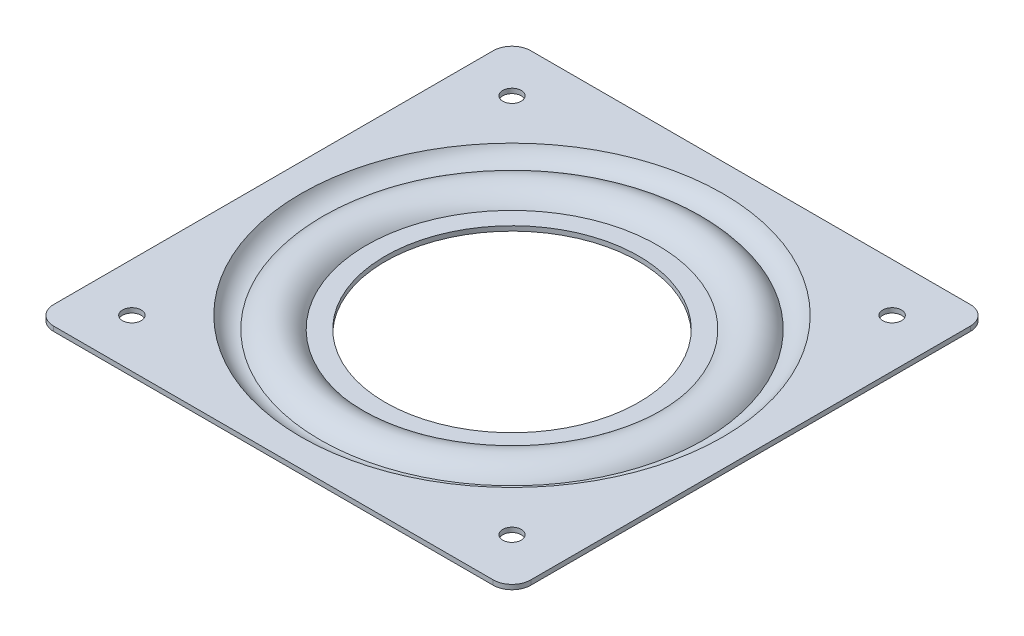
ISO-10303-21;
HEADER;
FILE_DESCRIPTION(('STEP AP214'),'2;1');
FILE_NAME('part.step','',(''),(''),'','','');
FILE_SCHEMA(('AUTOMOTIVE_DESIGN { 1 0 10303 214 1 1 1 1 }'));
ENDSEC;
DATA;
#1=APPLICATION_CONTEXT('core data for automotive mechanical design processes');
#2=APPLICATION_PROTOCOL_DEFINITION('international standard','automotive_design',2000,#1);
#3=PRODUCT_CONTEXT('',#1,'mechanical');
#4=PRODUCT('Part','Part','',(#3));
#5=PRODUCT_RELATED_PRODUCT_CATEGORY('part','',(#4));
#6=PRODUCT_DEFINITION_FORMATION('','',#4);
#7=PRODUCT_DEFINITION_CONTEXT('part definition',#1,'design');
#8=PRODUCT_DEFINITION('design','',#6,#7);
#9=PRODUCT_DEFINITION_SHAPE('','',#8);
#10=(LENGTH_UNIT() NAMED_UNIT(*) SI_UNIT(.MILLI.,.METRE.));
#11=(NAMED_UNIT(*) PLANE_ANGLE_UNIT() SI_UNIT($,.RADIAN.));
#12=(NAMED_UNIT(*) SI_UNIT($,.STERADIAN.) SOLID_ANGLE_UNIT());
#13=UNCERTAINTY_MEASURE_WITH_UNIT(LENGTH_MEASURE(1.E-05),#10,'distance_accuracy_value','');
#14=(GEOMETRIC_REPRESENTATION_CONTEXT(3) GLOBAL_UNCERTAINTY_ASSIGNED_CONTEXT((#13)) GLOBAL_UNIT_ASSIGNED_CONTEXT((#10,
#11,#12)) REPRESENTATION_CONTEXT('',''));
#15=CARTESIAN_POINT('',(0.,0.,0.));
#16=DIRECTION('',(0.,0.,1.));
#17=DIRECTION('',(1.,0.,0.));
#18=AXIS2_PLACEMENT_3D('',#15,#16,#17);
#19=CARTESIAN_POINT('',(0.,1.93021402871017,0.));
#20=DIRECTION('',(0.,1.,0.));
#21=DIRECTION('',(0.,0.,1.));
#22=AXIS2_PLACEMENT_3D('',#19,#20,#21);
#23=TOROIDAL_SURFACE('',#22,40.8455333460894,5.5);
#24=CARTESIAN_POINT('',(0.,-3.5402036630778,0.));
#25=DIRECTION('',(0.,1.,0.));
#26=DIRECTION('',(0.,0.,1.));
#27=AXIS2_PLACEMENT_3D('',#24,#25,#26);
#28=CIRCLE('',#27,40.2758577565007);
#29=CARTESIAN_POINT('',(0.,-3.5402036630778,40.2758577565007));
#30=VERTEX_POINT('',#29);
#31=EDGE_CURVE('E11',#30,#30,#28,.T.);
#32=ORIENTED_EDGE('',*,*,#31,.T.);
#33=EDGE_LOOP('',(#32));
#34=FACE_BOUND('',#33,.T.);
#35=CARTESIAN_POINT('',(0.,-1.,0.));
#36=DIRECTION('',(0.,1.,0.));
#37=DIRECTION('',(0.,0.,1.));
#38=AXIS2_PLACEMENT_3D('',#35,#36,#37);
#39=CIRCLE('',#38,45.4999770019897);
#40=CARTESIAN_POINT('',(0.,-1.,45.4999770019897));
#41=VERTEX_POINT('',#40);
#42=EDGE_CURVE('E50',#41,#41,#39,.F.);
#43=ORIENTED_EDGE('',*,*,#42,.T.);
#44=EDGE_LOOP('',(#43));
#45=FACE_BOUND('',#44,.T.);
#46=ADVANCED_FACE('F47',(#34,#45),#23,.T.);
#47=CARTESIAN_POINT('',(0.,-6.,0.));
#48=DIRECTION('',(0.,1.,0.));
#49=DIRECTION('',(0.,0.,1.));
#50=AXIS2_PLACEMENT_3D('',#47,#48,#49);
#51=TOROIDAL_SURFACE('',#50,35.9227666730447,5.);
#52=CARTESIAN_POINT('',(0.,-3.56978597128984,0.));
#53=DIRECTION('',(0.,1.,0.));
#54=DIRECTION('',(0.,0.,1.));
#55=AXIS2_PLACEMENT_3D('',#52,#53,#54);
#56=CIRCLE('',#55,31.5530916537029);
#57=CARTESIAN_POINT('',(0.,-3.56978597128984,31.5530916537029));
#58=VERTEX_POINT('',#57);
#59=EDGE_CURVE('E57',#58,#58,#56,.T.);
#60=ORIENTED_EDGE('',*,*,#59,.T.);
#61=EDGE_LOOP('',(#60));
#62=FACE_BOUND('',#61,.T.);
#63=ORIENTED_EDGE('',*,*,#31,.F.);
#64=EDGE_LOOP('',(#63));
#65=FACE_BOUND('',#64,.T.);
#66=ADVANCED_FACE('F239',(#62,#65),#51,.F.);
#67=CARTESIAN_POINT('',(0.,-3.56978597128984,0.));
#68=DIRECTION('',(0.,-1.,0.));
#69=DIRECTION('',(0.,0.,-1.));
#70=AXIS2_PLACEMENT_3D('',#67,#68,#69);
#71=PLANE('',#70);
#72=CARTESIAN_POINT('',(0.,-3.56978597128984,0.));
#73=DIRECTION('',(0.,1.,0.));
#74=DIRECTION('',(0.,0.,1.));
#75=AXIS2_PLACEMENT_3D('',#72,#73,#74);
#76=CIRCLE('',#75,27.);
#77=CARTESIAN_POINT('',(0.,-3.56978597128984,27.));
#78=VERTEX_POINT('',#77);
#79=EDGE_CURVE('E231',#78,#78,#76,.T.);
#80=ORIENTED_EDGE('',*,*,#79,.T.);
#81=EDGE_LOOP('',(#80));
#82=FACE_BOUND('',#81,.T.);
#83=ORIENTED_EDGE('',*,*,#59,.F.);
#84=EDGE_LOOP('',(#83));
#85=FACE_BOUND('',#84,.T.);
#86=ADVANCED_FACE('F242',(#82,#85),#71,.T.);
#87=CARTESIAN_POINT('',(0.,6.91716042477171,0.));
#88=DIRECTION('',(0.,1.,0.));
#89=DIRECTION('',(0.,0.,1.));
#90=AXIS2_PLACEMENT_3D('',#87,#88,#89);
#91=CYLINDRICAL_SURFACE('',#90,27.);
#92=ORIENTED_EDGE('',*,*,#79,.F.);
#93=EDGE_LOOP('',(#92));
#94=FACE_BOUND('',#93,.T.);
#95=CARTESIAN_POINT('',(0.,-2.56978597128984,0.));
#96=DIRECTION('',(0.,1.,0.));
#97=DIRECTION('',(0.,0.,1.));
#98=AXIS2_PLACEMENT_3D('',#95,#96,#97);
#99=CIRCLE('',#98,27.);
#100=CARTESIAN_POINT('',(0.,-2.56978597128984,27.));
#101=VERTEX_POINT('',#100);
#102=EDGE_CURVE('E227',#101,#101,#99,.T.);
#103=ORIENTED_EDGE('',*,*,#102,.T.);
#104=EDGE_LOOP('',(#103));
#105=FACE_BOUND('',#104,.T.);
#106=ADVANCED_FACE('F244',(#94,#105),#91,.F.);
#107=CARTESIAN_POINT('',(0.,-2.56978597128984,0.));
#108=DIRECTION('',(0.,-1.,0.));
#109=DIRECTION('',(0.,0.,-1.));
#110=AXIS2_PLACEMENT_3D('',#107,#108,#109);
#111=PLANE('',#110);
#112=ORIENTED_EDGE('',*,*,#102,.F.);
#113=EDGE_LOOP('',(#112));
#114=FACE_BOUND('',#113,.T.);
#115=CARTESIAN_POINT('',(0.,-2.56978597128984,0.));
#116=DIRECTION('',(0.,1.,0.));
#117=DIRECTION('',(0.,0.,1.));
#118=AXIS2_PLACEMENT_3D('',#115,#116,#117);
#119=CIRCLE('',#118,31.);
#120=CARTESIAN_POINT('',(0.,-2.56978597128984,31.));
#121=VERTEX_POINT('',#120);
#122=EDGE_CURVE('E223',#121,#121,#119,.T.);
#123=ORIENTED_EDGE('',*,*,#122,.T.);
#124=EDGE_LOOP('',(#123));
#125=FACE_BOUND('',#124,.T.);
#126=ADVANCED_FACE('F251',(#114,#125),#111,.F.);
#127=CARTESIAN_POINT('',(0.,-6.,0.));
#128=DIRECTION('',(0.,1.,0.));
#129=DIRECTION('',(0.,0.,1.));
#130=AXIS2_PLACEMENT_3D('',#127,#128,#129);
#131=TOROIDAL_SURFACE('',#130,35.9227666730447,6.);
#132=ORIENTED_EDGE('',*,*,#122,.F.);
#133=EDGE_LOOP('',(#132));
#134=FACE_BOUND('',#133,.T.);
#135=CARTESIAN_POINT('',(0.,-2.56978597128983,0.));
#136=DIRECTION('',(0.,1.,0.));
#137=DIRECTION('',(0.,0.,1.));
#138=AXIS2_PLACEMENT_3D('',#135,#136,#137);
#139=CIRCLE('',#138,40.8455333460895);
#140=CARTESIAN_POINT('',(0.,-2.56978597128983,40.8455333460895));
#141=VERTEX_POINT('',#140);
#142=EDGE_CURVE('E219',#141,#141,#139,.T.);
#143=ORIENTED_EDGE('',*,*,#142,.T.);
#144=EDGE_LOOP('',(#143));
#145=FACE_BOUND('',#144,.T.);
#146=ADVANCED_FACE('F353',(#134,#145),#131,.T.);
#147=CARTESIAN_POINT('',(0.,1.93021402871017,0.));
#148=DIRECTION('',(0.,1.,0.));
#149=DIRECTION('',(0.,0.,1.));
#150=AXIS2_PLACEMENT_3D('',#147,#148,#149);
#151=TOROIDAL_SURFACE('',#150,40.8455333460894,4.5);
#152=ORIENTED_EDGE('',*,*,#142,.F.);
#153=EDGE_LOOP('',(#152));
#154=FACE_BOUND('',#153,.T.);
#155=CARTESIAN_POINT('',(0.,0.,0.));
#156=DIRECTION('',(0.,1.,0.));
#157=DIRECTION('',(0.,0.,1.));
#158=AXIS2_PLACEMENT_3D('',#155,#156,#157);
#159=CIRCLE('',#158,44.9105393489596);
#160=CARTESIAN_POINT('',(0.,0.,44.9105393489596));
#161=VERTEX_POINT('',#160);
#162=EDGE_CURVE('E152',#161,#161,#159,.T.);
#163=ORIENTED_EDGE('',*,*,#162,.T.);
#164=EDGE_LOOP('',(#163));
#165=FACE_BOUND('',#164,.T.);
#166=ADVANCED_FACE('F321',(#154,#165),#151,.F.);
#167=CARTESIAN_POINT('',(-50.8,-1.,0.));
#168=DIRECTION('',(-1.,0.,0.));
#169=DIRECTION('',(0.,0.,1.));
#170=AXIS2_PLACEMENT_3D('',#167,#168,#169);
#171=PLANE('',#170);
#172=DIRECTION('',(0.,0.,1.));
#173=VECTOR('',#172,1.);
#174=CARTESIAN_POINT('',(-50.8,0.,0.));
#175=LINE('',#174,#173);
#176=CARTESIAN_POINT('',(-50.8,0.,-46.8000000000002));
#177=VERTEX_POINT('',#176);
#178=CARTESIAN_POINT('',(-50.8,0.,46.7999999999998));
#179=VERTEX_POINT('',#178);
#180=EDGE_CURVE('E172',#177,#179,#175,.T.);
#181=ORIENTED_EDGE('',*,*,#180,.F.);
#182=DIRECTION('',(0.,1.,0.));
#183=VECTOR('',#182,1.);
#184=CARTESIAN_POINT('',(-50.8,-1.,-46.8000000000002));
#185=LINE('',#184,#183);
#186=CARTESIAN_POINT('',(-50.8,-1.,-46.8000000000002));
#187=VERTEX_POINT('',#186);
#188=EDGE_CURVE('E65',#187,#177,#185,.T.);
#189=ORIENTED_EDGE('',*,*,#188,.F.);
#190=DIRECTION('',(0.,0.,1.));
#191=VECTOR('',#190,1.);
#192=CARTESIAN_POINT('',(-50.8,-1.,0.));
#193=LINE('',#192,#191);
#194=CARTESIAN_POINT('',(-50.8,-1.,46.7999999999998));
#195=VERTEX_POINT('',#194);
#196=EDGE_CURVE('E287',#187,#195,#193,.T.);
#197=ORIENTED_EDGE('',*,*,#196,.T.);
#198=DIRECTION('',(0.,1.,0.));
#199=VECTOR('',#198,1.);
#200=CARTESIAN_POINT('',(-50.8,-1.,46.7999999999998));
#201=LINE('',#200,#199);
#202=EDGE_CURVE('E106',#195,#179,#201,.T.);
#203=ORIENTED_EDGE('',*,*,#202,.T.);
#204=EDGE_LOOP('',(#181,#189,#197,#203));
#205=FACE_BOUND('',#204,.T.);
#206=ADVANCED_FACE('F312',(#205),#171,.T.);
#207=CARTESIAN_POINT('',(-46.8,-1.,-46.8000000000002));
#208=DIRECTION('',(0.,1.,0.));
#209=DIRECTION('',(0.,0.,1.));
#210=AXIS2_PLACEMENT_3D('',#207,#208,#209);
#211=CYLINDRICAL_SURFACE('',#210,4.00000000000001);
#212=CARTESIAN_POINT('',(-46.8,0.,-46.8000000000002));
#213=DIRECTION('',(0.,1.,0.));
#214=DIRECTION('',(0.,0.,1.));
#215=AXIS2_PLACEMENT_3D('',#212,#213,#214);
#216=CIRCLE('',#215,4.00000000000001);
#217=CARTESIAN_POINT('',(-46.8,0.,-50.8000000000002));
#218=VERTEX_POINT('',#217);
#219=EDGE_CURVE('E197',#218,#177,#216,.T.);
#220=ORIENTED_EDGE('',*,*,#219,.F.);
#221=DIRECTION('',(0.,1.,0.));
#222=VECTOR('',#221,1.);
#223=CARTESIAN_POINT('',(-46.8,-1.,-50.8000000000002));
#224=LINE('',#223,#222);
#225=CARTESIAN_POINT('',(-46.8,-1.,-50.8000000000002));
#226=VERTEX_POINT('',#225);
#227=EDGE_CURVE('E94',#226,#218,#224,.T.);
#228=ORIENTED_EDGE('',*,*,#227,.F.);
#229=CARTESIAN_POINT('',(-46.8,-1.,-46.8000000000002));
#230=DIRECTION('',(0.,1.,0.));
#231=DIRECTION('',(0.,0.,1.));
#232=AXIS2_PLACEMENT_3D('',#229,#230,#231);
#233=CIRCLE('',#232,4.00000000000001);
#234=EDGE_CURVE('E128',#226,#187,#233,.T.);
#235=ORIENTED_EDGE('',*,*,#234,.T.);
#236=ORIENTED_EDGE('',*,*,#188,.T.);
#237=EDGE_LOOP('',(#220,#228,#235,#236));
#238=FACE_BOUND('',#237,.T.);
#239=ADVANCED_FACE('F314',(#238),#211,.T.);
#240=CARTESIAN_POINT('',(0.,-1.,-50.8000000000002));
#241=DIRECTION('',(0.,0.,1.));
#242=DIRECTION('',(1.,0.,0.));
#243=AXIS2_PLACEMENT_3D('',#240,#241,#242);
#244=PLANE('',#243);
#245=DIRECTION('',(1.,0.,0.));
#246=VECTOR('',#245,1.);
#247=CARTESIAN_POINT('',(0.,0.,-50.8000000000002));
#248=LINE('',#247,#246);
#249=CARTESIAN_POINT('',(46.8,0.,-50.8000000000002));
#250=VERTEX_POINT('',#249);
#251=EDGE_CURVE('E133',#218,#250,#248,.T.);
#252=ORIENTED_EDGE('',*,*,#251,.T.);
#253=DIRECTION('',(0.,1.,0.));
#254=VECTOR('',#253,1.);
#255=CARTESIAN_POINT('',(46.8,-1.,-50.8000000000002));
#256=LINE('',#255,#254);
#257=CARTESIAN_POINT('',(46.8,-1.,-50.8000000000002));
#258=VERTEX_POINT('',#257);
#259=EDGE_CURVE('E131',#258,#250,#256,.T.);
#260=ORIENTED_EDGE('',*,*,#259,.F.);
#261=DIRECTION('',(1.,0.,0.));
#262=VECTOR('',#261,1.);
#263=CARTESIAN_POINT('',(0.,-1.,-50.8000000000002));
#264=LINE('',#263,#262);
#265=EDGE_CURVE('E123',#226,#258,#264,.T.);
#266=ORIENTED_EDGE('',*,*,#265,.F.);
#267=ORIENTED_EDGE('',*,*,#227,.T.);
#268=EDGE_LOOP('',(#252,#260,#266,#267));
#269=FACE_BOUND('',#268,.T.);
#270=ADVANCED_FACE('F132',(#269),#244,.F.);
#271=CARTESIAN_POINT('',(46.8,-1.,-46.8000000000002));
#272=DIRECTION('',(0.,1.,0.));
#273=DIRECTION('',(0.,0.,1.));
#274=AXIS2_PLACEMENT_3D('',#271,#272,#273);
#275=CYLINDRICAL_SURFACE('',#274,4.);
#276=CARTESIAN_POINT('',(46.8,0.,-46.8000000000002));
#277=DIRECTION('',(0.,1.,0.));
#278=DIRECTION('',(0.,0.,1.));
#279=AXIS2_PLACEMENT_3D('',#276,#277,#278);
#280=CIRCLE('',#279,4.);
#281=CARTESIAN_POINT('',(50.8,0.,-46.8000000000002));
#282=VERTEX_POINT('',#281);
#283=EDGE_CURVE('E192',#282,#250,#280,.T.);
#284=ORIENTED_EDGE('',*,*,#283,.F.);
#285=DIRECTION('',(0.,1.,0.));
#286=VECTOR('',#285,1.);
#287=CARTESIAN_POINT('',(50.8,-1.,-46.8000000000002));
#288=LINE('',#287,#286);
#289=CARTESIAN_POINT('',(50.8,-1.,-46.8000000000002));
#290=VERTEX_POINT('',#289);
#291=EDGE_CURVE('E138',#290,#282,#288,.T.);
#292=ORIENTED_EDGE('',*,*,#291,.F.);
#293=CARTESIAN_POINT('',(46.8,-1.,-46.8000000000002));
#294=DIRECTION('',(0.,1.,0.));
#295=DIRECTION('',(0.,0.,1.));
#296=AXIS2_PLACEMENT_3D('',#293,#294,#295);
#297=CIRCLE('',#296,4.);
#298=EDGE_CURVE('E127',#290,#258,#297,.T.);
#299=ORIENTED_EDGE('',*,*,#298,.T.);
#300=ORIENTED_EDGE('',*,*,#259,.T.);
#301=EDGE_LOOP('',(#284,#292,#299,#300));
#302=FACE_BOUND('',#301,.T.);
#303=ADVANCED_FACE('F140',(#302),#275,.T.);
#304=CARTESIAN_POINT('',(50.8,-1.,0.));
#305=DIRECTION('',(-1.,0.,0.));
#306=DIRECTION('',(0.,0.,1.));
#307=AXIS2_PLACEMENT_3D('',#304,#305,#306);
#308=PLANE('',#307);
#309=DIRECTION('',(0.,0.,1.));
#310=VECTOR('',#309,1.);
#311=CARTESIAN_POINT('',(50.8,0.,0.));
#312=LINE('',#311,#310);
#313=CARTESIAN_POINT('',(50.8,0.,46.7999999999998));
#314=VERTEX_POINT('',#313);
#315=EDGE_CURVE('E188',#282,#314,#312,.T.);
#316=ORIENTED_EDGE('',*,*,#315,.T.);
#317=DIRECTION('',(0.,1.,0.));
#318=VECTOR('',#317,1.);
#319=CARTESIAN_POINT('',(50.8,-1.,46.7999999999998));
#320=LINE('',#319,#318);
#321=CARTESIAN_POINT('',(50.8,-1.,46.7999999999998));
#322=VERTEX_POINT('',#321);
#323=EDGE_CURVE('E208',#322,#314,#320,.T.);
#324=ORIENTED_EDGE('',*,*,#323,.F.);
#325=DIRECTION('',(0.,0.,1.));
#326=VECTOR('',#325,1.);
#327=CARTESIAN_POINT('',(50.8,-1.,0.));
#328=LINE('',#327,#326);
#329=EDGE_CURVE('E143',#290,#322,#328,.T.);
#330=ORIENTED_EDGE('',*,*,#329,.F.);
#331=ORIENTED_EDGE('',*,*,#291,.T.);
#332=EDGE_LOOP('',(#316,#324,#330,#331));
#333=FACE_BOUND('',#332,.T.);
#334=ADVANCED_FACE('F327',(#333),#308,.F.);
#335=CARTESIAN_POINT('',(46.8,-1.,46.7999999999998));
#336=DIRECTION('',(0.,1.,0.));
#337=DIRECTION('',(0.,0.,1.));
#338=AXIS2_PLACEMENT_3D('',#335,#336,#337);
#339=CYLINDRICAL_SURFACE('',#338,4.00000000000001);
#340=CARTESIAN_POINT('',(46.8,0.,46.7999999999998));
#341=DIRECTION('',(0.,1.,0.));
#342=DIRECTION('',(0.,0.,1.));
#343=AXIS2_PLACEMENT_3D('',#340,#341,#342);
#344=CIRCLE('',#343,4.00000000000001);
#345=CARTESIAN_POINT('',(46.8,0.,50.7999999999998));
#346=VERTEX_POINT('',#345);
#347=EDGE_CURVE('E184',#346,#314,#344,.T.);
#348=ORIENTED_EDGE('',*,*,#347,.F.);
#349=DIRECTION('',(0.,1.,0.));
#350=VECTOR('',#349,1.);
#351=CARTESIAN_POINT('',(46.8,-1.,50.7999999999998));
#352=LINE('',#351,#350);
#353=CARTESIAN_POINT('',(46.8,-1.,50.7999999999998));
#354=VERTEX_POINT('',#353);
#355=EDGE_CURVE('E211',#354,#346,#352,.T.);
#356=ORIENTED_EDGE('',*,*,#355,.F.);
#357=CARTESIAN_POINT('',(46.8,-1.,46.7999999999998));
#358=DIRECTION('',(0.,1.,0.));
#359=DIRECTION('',(0.,0.,1.));
#360=AXIS2_PLACEMENT_3D('',#357,#358,#359);
#361=CIRCLE('',#360,4.00000000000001);
#362=EDGE_CURVE('E146',#354,#322,#361,.T.);
#363=ORIENTED_EDGE('',*,*,#362,.T.);
#364=ORIENTED_EDGE('',*,*,#323,.T.);
#365=EDGE_LOOP('',(#348,#356,#363,#364));
#366=FACE_BOUND('',#365,.T.);
#367=ADVANCED_FACE('F306',(#366),#339,.T.);
#368=CARTESIAN_POINT('',(0.,-1.,50.7999999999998));
#369=DIRECTION('',(0.,0.,1.));
#370=DIRECTION('',(1.,0.,0.));
#371=AXIS2_PLACEMENT_3D('',#368,#369,#370);
#372=PLANE('',#371);
#373=DIRECTION('',(1.,0.,0.));
#374=VECTOR('',#373,1.);
#375=CARTESIAN_POINT('',(0.,0.,50.7999999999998));
#376=LINE('',#375,#374);
#377=CARTESIAN_POINT('',(-46.8,0.,50.7999999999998));
#378=VERTEX_POINT('',#377);
#379=EDGE_CURVE('E180',#378,#346,#376,.T.);
#380=ORIENTED_EDGE('',*,*,#379,.F.);
#381=DIRECTION('',(0.,1.,0.));
#382=VECTOR('',#381,1.);
#383=CARTESIAN_POINT('',(-46.8,-1.,50.7999999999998));
#384=LINE('',#383,#382);
#385=CARTESIAN_POINT('',(-46.8,-1.,50.7999999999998));
#386=VERTEX_POINT('',#385);
#387=EDGE_CURVE('E214',#386,#378,#384,.T.);
#388=ORIENTED_EDGE('',*,*,#387,.F.);
#389=DIRECTION('',(1.,0.,0.));
#390=VECTOR('',#389,1.);
#391=CARTESIAN_POINT('',(0.,-1.,50.7999999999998));
#392=LINE('',#391,#390);
#393=EDGE_CURVE('E298',#386,#354,#392,.T.);
#394=ORIENTED_EDGE('',*,*,#393,.T.);
#395=ORIENTED_EDGE('',*,*,#355,.T.);
#396=EDGE_LOOP('',(#380,#388,#394,#395));
#397=FACE_BOUND('',#396,.T.);
#398=ADVANCED_FACE('F311',(#397),#372,.T.);
#399=CARTESIAN_POINT('',(-40.4800000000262,-1.,40.480000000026));
#400=DIRECTION('',(0.,1.,0.));
#401=DIRECTION('',(0.,0.,1.));
#402=AXIS2_PLACEMENT_3D('',#399,#400,#401);
#403=CYLINDRICAL_SURFACE('',#402,1.985);
#404=CARTESIAN_POINT('',(-40.4800000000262,-1.,40.480000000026));
#405=DIRECTION('',(0.,1.,0.));
#406=DIRECTION('',(0.,0.,1.));
#407=AXIS2_PLACEMENT_3D('',#404,#405,#406);
#408=CIRCLE('',#407,1.985);
#409=CARTESIAN_POINT('',(-40.4800000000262,-1.,42.465000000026));
#410=VERTEX_POINT('',#409);
#411=EDGE_CURVE('E284',#410,#410,#408,.T.);
#412=ORIENTED_EDGE('',*,*,#411,.F.);
#413=EDGE_LOOP('',(#412));
#414=FACE_BOUND('',#413,.T.);
#415=CARTESIAN_POINT('',(-40.4800000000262,0.,40.480000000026));
#416=DIRECTION('',(0.,1.,0.));
#417=DIRECTION('',(0.,0.,1.));
#418=AXIS2_PLACEMENT_3D('',#415,#416,#417);
#419=CIRCLE('',#418,1.985);
#420=CARTESIAN_POINT('',(-40.4800000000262,0.,42.465000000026));
#421=VERTEX_POINT('',#420);
#422=EDGE_CURVE('E168',#421,#421,#419,.T.);
#423=ORIENTED_EDGE('',*,*,#422,.T.);
#424=EDGE_LOOP('',(#423));
#425=FACE_BOUND('',#424,.T.);
#426=ADVANCED_FACE('F335',(#414,#425),#403,.F.);
#427=CARTESIAN_POINT('',(40.4800000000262,-1.,40.480000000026));
#428=DIRECTION('',(0.,1.,0.));
#429=DIRECTION('',(0.,0.,1.));
#430=AXIS2_PLACEMENT_3D('',#427,#428,#429);
#431=CYLINDRICAL_SURFACE('',#430,1.985);
#432=CARTESIAN_POINT('',(40.4800000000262,-1.,40.480000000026));
#433=DIRECTION('',(0.,1.,0.));
#434=DIRECTION('',(0.,0.,1.));
#435=AXIS2_PLACEMENT_3D('',#432,#433,#434);
#436=CIRCLE('',#435,1.985);
#437=CARTESIAN_POINT('',(40.4800000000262,-1.,42.465000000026));
#438=VERTEX_POINT('',#437);
#439=EDGE_CURVE('E281',#438,#438,#436,.T.);
#440=ORIENTED_EDGE('',*,*,#439,.F.);
#441=EDGE_LOOP('',(#440));
#442=FACE_BOUND('',#441,.T.);
#443=CARTESIAN_POINT('',(40.4800000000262,0.,40.480000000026));
#444=DIRECTION('',(0.,1.,0.));
#445=DIRECTION('',(0.,0.,1.));
#446=AXIS2_PLACEMENT_3D('',#443,#444,#445);
#447=CIRCLE('',#446,1.985);
#448=CARTESIAN_POINT('',(40.4800000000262,0.,42.465000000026));
#449=VERTEX_POINT('',#448);
#450=EDGE_CURVE('E164',#449,#449,#447,.T.);
#451=ORIENTED_EDGE('',*,*,#450,.T.);
#452=EDGE_LOOP('',(#451));
#453=FACE_BOUND('',#452,.T.);
#454=ADVANCED_FACE('F341',(#442,#453),#431,.F.);
#455=CARTESIAN_POINT('',(40.4800000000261,-1.,-40.4800000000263));
#456=DIRECTION('',(0.,1.,0.));
#457=DIRECTION('',(0.,0.,1.));
#458=AXIS2_PLACEMENT_3D('',#455,#456,#457);
#459=CYLINDRICAL_SURFACE('',#458,1.985);
#460=CARTESIAN_POINT('',(40.4800000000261,-1.,-40.4800000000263));
#461=DIRECTION('',(0.,1.,0.));
#462=DIRECTION('',(0.,0.,1.));
#463=AXIS2_PLACEMENT_3D('',#460,#461,#462);
#464=CIRCLE('',#463,1.985);
#465=CARTESIAN_POINT('',(40.4800000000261,-1.,-38.4950000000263));
#466=VERTEX_POINT('',#465);
#467=EDGE_CURVE('E277',#466,#466,#464,.T.);
#468=ORIENTED_EDGE('',*,*,#467,.F.);
#469=EDGE_LOOP('',(#468));
#470=FACE_BOUND('',#469,.T.);
#471=CARTESIAN_POINT('',(40.4800000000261,0.,-40.4800000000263));
#472=DIRECTION('',(0.,1.,0.));
#473=DIRECTION('',(0.,0.,1.));
#474=AXIS2_PLACEMENT_3D('',#471,#472,#473);
#475=CIRCLE('',#474,1.985);
#476=CARTESIAN_POINT('',(40.4800000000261,0.,-38.4950000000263));
#477=VERTEX_POINT('',#476);
#478=EDGE_CURVE('E160',#477,#477,#475,.T.);
#479=ORIENTED_EDGE('',*,*,#478,.T.);
#480=EDGE_LOOP('',(#479));
#481=FACE_BOUND('',#480,.T.);
#482=ADVANCED_FACE('F344',(#470,#481),#459,.F.);
#483=CARTESIAN_POINT('',(-40.4800000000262,-1.,-40.4800000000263));
#484=DIRECTION('',(0.,1.,0.));
#485=DIRECTION('',(0.,0.,1.));
#486=AXIS2_PLACEMENT_3D('',#483,#484,#485);
#487=CYLINDRICAL_SURFACE('',#486,1.985);
#488=CARTESIAN_POINT('',(-40.4800000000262,-1.,-40.4800000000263));
#489=DIRECTION('',(0.,1.,0.));
#490=DIRECTION('',(0.,0.,1.));
#491=AXIS2_PLACEMENT_3D('',#488,#489,#490);
#492=CIRCLE('',#491,1.985);
#493=CARTESIAN_POINT('',(-40.4800000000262,-1.,-38.4950000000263));
#494=VERTEX_POINT('',#493);
#495=EDGE_CURVE('E201',#494,#494,#492,.T.);
#496=ORIENTED_EDGE('',*,*,#495,.F.);
#497=EDGE_LOOP('',(#496));
#498=FACE_BOUND('',#497,.T.);
#499=CARTESIAN_POINT('',(-40.4800000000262,0.,-40.4800000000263));
#500=DIRECTION('',(0.,1.,0.));
#501=DIRECTION('',(0.,0.,1.));
#502=AXIS2_PLACEMENT_3D('',#499,#500,#501);
#503=CIRCLE('',#502,1.985);
#504=CARTESIAN_POINT('',(-40.4800000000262,0.,-38.4950000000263));
#505=VERTEX_POINT('',#504);
#506=EDGE_CURVE('E156',#505,#505,#503,.T.);
#507=ORIENTED_EDGE('',*,*,#506,.T.);
#508=EDGE_LOOP('',(#507));
#509=FACE_BOUND('',#508,.T.);
#510=ADVANCED_FACE('F337',(#498,#509),#487,.F.);
#511=CARTESIAN_POINT('',(-46.8,-1.,46.7999999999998));
#512=DIRECTION('',(0.,1.,0.));
#513=DIRECTION('',(0.,0.,1.));
#514=AXIS2_PLACEMENT_3D('',#511,#512,#513);
#515=CYLINDRICAL_SURFACE('',#514,4.);
#516=CARTESIAN_POINT('',(-46.8,0.,46.7999999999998));
#517=DIRECTION('',(0.,1.,0.));
#518=DIRECTION('',(0.,0.,1.));
#519=AXIS2_PLACEMENT_3D('',#516,#517,#518);
#520=CIRCLE('',#519,4.);
#521=EDGE_CURVE('E176',#179,#378,#520,.T.);
#522=ORIENTED_EDGE('',*,*,#521,.F.);
#523=ORIENTED_EDGE('',*,*,#202,.F.);
#524=CARTESIAN_POINT('',(-46.8,-1.,46.7999999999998));
#525=DIRECTION('',(0.,1.,0.));
#526=DIRECTION('',(0.,0.,1.));
#527=AXIS2_PLACEMENT_3D('',#524,#525,#526);
#528=CIRCLE('',#527,4.);
#529=EDGE_CURVE('E291',#195,#386,#528,.T.);
#530=ORIENTED_EDGE('',*,*,#529,.T.);
#531=ORIENTED_EDGE('',*,*,#387,.T.);
#532=EDGE_LOOP('',(#522,#523,#530,#531));
#533=FACE_BOUND('',#532,.T.);
#534=ADVANCED_FACE('F269',(#533),#515,.T.);
#535=CARTESIAN_POINT('',(0.,-1.,0.));
#536=DIRECTION('',(0.,1.,0.));
#537=DIRECTION('',(0.,0.,1.));
#538=AXIS2_PLACEMENT_3D('',#535,#536,#537);
#539=PLANE('',#538);
#540=ORIENTED_EDGE('',*,*,#42,.F.);
#541=EDGE_LOOP('',(#540));
#542=FACE_BOUND('',#541,.T.);
#543=ORIENTED_EDGE('',*,*,#495,.T.);
#544=EDGE_LOOP('',(#543));
#545=FACE_BOUND('',#544,.T.);
#546=ORIENTED_EDGE('',*,*,#467,.T.);
#547=EDGE_LOOP('',(#546));
#548=FACE_BOUND('',#547,.T.);
#549=ORIENTED_EDGE('',*,*,#439,.T.);
#550=EDGE_LOOP('',(#549));
#551=FACE_BOUND('',#550,.T.);
#552=ORIENTED_EDGE('',*,*,#411,.T.);
#553=EDGE_LOOP('',(#552));
#554=FACE_BOUND('',#553,.T.);
#555=ORIENTED_EDGE('',*,*,#196,.F.);
#556=ORIENTED_EDGE('',*,*,#234,.F.);
#557=ORIENTED_EDGE('',*,*,#265,.T.);
#558=ORIENTED_EDGE('',*,*,#298,.F.);
#559=ORIENTED_EDGE('',*,*,#329,.T.);
#560=ORIENTED_EDGE('',*,*,#362,.F.);
#561=ORIENTED_EDGE('',*,*,#393,.F.);
#562=ORIENTED_EDGE('',*,*,#529,.F.);
#563=EDGE_LOOP('',(#555,#556,#557,#558,#559,#560,#561,#562));
#564=FACE_BOUND('',#563,.T.);
#565=ADVANCED_FACE('F125',(#542,#545,#548,#551,#554,#564),#539,.F.);
#566=CARTESIAN_POINT('',(0.,0.,0.));
#567=DIRECTION('',(0.,1.,0.));
#568=DIRECTION('',(0.,0.,1.));
#569=AXIS2_PLACEMENT_3D('',#566,#567,#568);
#570=PLANE('',#569);
#571=ORIENTED_EDGE('',*,*,#162,.F.);
#572=EDGE_LOOP('',(#571));
#573=FACE_BOUND('',#572,.T.);
#574=ORIENTED_EDGE('',*,*,#506,.F.);
#575=EDGE_LOOP('',(#574));
#576=FACE_BOUND('',#575,.T.);
#577=ORIENTED_EDGE('',*,*,#478,.F.);
#578=EDGE_LOOP('',(#577));
#579=FACE_BOUND('',#578,.T.);
#580=ORIENTED_EDGE('',*,*,#450,.F.);
#581=EDGE_LOOP('',(#580));
#582=FACE_BOUND('',#581,.T.);
#583=ORIENTED_EDGE('',*,*,#422,.F.);
#584=EDGE_LOOP('',(#583));
#585=FACE_BOUND('',#584,.T.);
#586=ORIENTED_EDGE('',*,*,#180,.T.);
#587=ORIENTED_EDGE('',*,*,#521,.T.);
#588=ORIENTED_EDGE('',*,*,#379,.T.);
#589=ORIENTED_EDGE('',*,*,#347,.T.);
#590=ORIENTED_EDGE('',*,*,#315,.F.);
#591=ORIENTED_EDGE('',*,*,#283,.T.);
#592=ORIENTED_EDGE('',*,*,#251,.F.);
#593=ORIENTED_EDGE('',*,*,#219,.T.);
#594=EDGE_LOOP('',(#586,#587,#588,#589,#590,#591,#592,#593));
#595=FACE_BOUND('',#594,.T.);
#596=ADVANCED_FACE('F268',(#573,#576,#579,#582,#585,#595),#570,.T.);
#597=CLOSED_SHELL('',(#46,#66,#86,#106,#126,#146,#166,#206,#239,#270,#303,#334,#367,#398,#426,
#454,#482,#510,#534,#565,#596));
#598=MANIFOLD_SOLID_BREP('B2',#597);
#599=ADVANCED_BREP_SHAPE_REPRESENTATION('',(#18,#598),#14);
#600=SHAPE_DEFINITION_REPRESENTATION(#9,#599);
ENDSEC;
END-ISO-10303-21;
